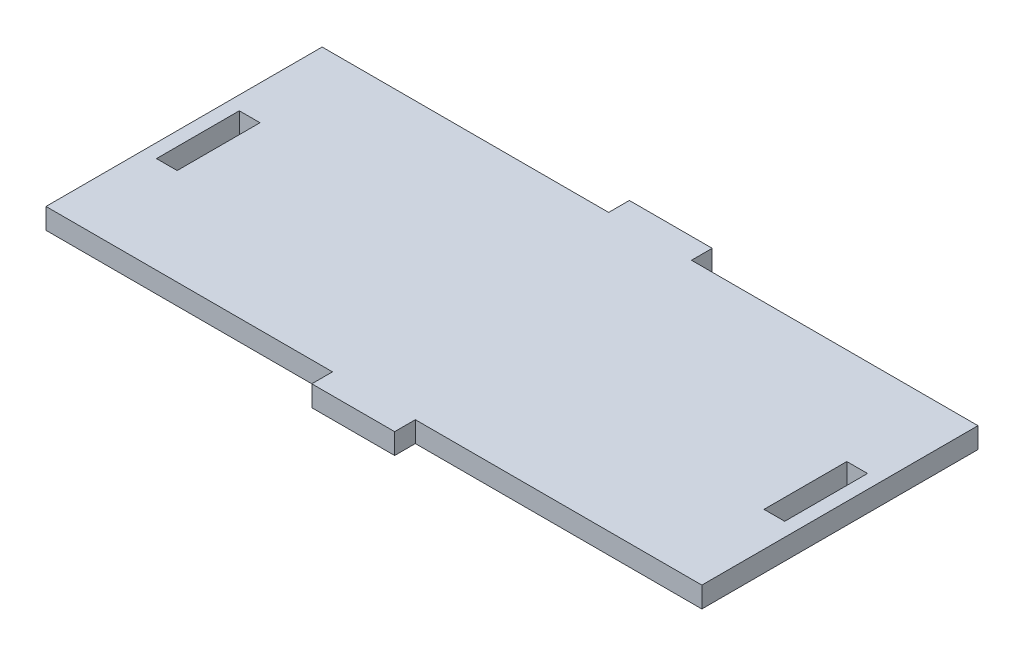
ISO-10303-21;
HEADER;
FILE_DESCRIPTION(('STEP AP214'),'2;1');
FILE_NAME('part.step','',(''),(''),'','','');
FILE_SCHEMA(('AUTOMOTIVE_DESIGN { 1 0 10303 214 1 1 1 1 }'));
ENDSEC;
DATA;
#1=APPLICATION_CONTEXT('core data for automotive mechanical design processes');
#2=APPLICATION_PROTOCOL_DEFINITION('international standard','automotive_design',2000,#1);
#3=PRODUCT_CONTEXT('',#1,'mechanical');
#4=PRODUCT('Part','Part','',(#3));
#5=PRODUCT_RELATED_PRODUCT_CATEGORY('part','',(#4));
#6=PRODUCT_DEFINITION_FORMATION('','',#4);
#7=PRODUCT_DEFINITION_CONTEXT('part definition',#1,'design');
#8=PRODUCT_DEFINITION('design','',#6,#7);
#9=PRODUCT_DEFINITION_SHAPE('','',#8);
#10=(LENGTH_UNIT() NAMED_UNIT(*) SI_UNIT(.MILLI.,.METRE.));
#11=(NAMED_UNIT(*) PLANE_ANGLE_UNIT() SI_UNIT($,.RADIAN.));
#12=(NAMED_UNIT(*) SI_UNIT($,.STERADIAN.) SOLID_ANGLE_UNIT());
#13=UNCERTAINTY_MEASURE_WITH_UNIT(LENGTH_MEASURE(1.E-05),#10,'distance_accuracy_value','');
#14=(GEOMETRIC_REPRESENTATION_CONTEXT(3) GLOBAL_UNCERTAINTY_ASSIGNED_CONTEXT((#13)) GLOBAL_UNIT_ASSIGNED_CONTEXT((#10,
#11,#12)) REPRESENTATION_CONTEXT('',''));
#15=CARTESIAN_POINT('',(0.,0.,0.));
#16=DIRECTION('',(0.,0.,1.));
#17=DIRECTION('',(1.,0.,0.));
#18=AXIS2_PLACEMENT_3D('',#15,#16,#17);
#19=CARTESIAN_POINT('',(0.,3.,7.49834222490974E-13));
#20=DIRECTION('',(0.,0.,-1.));
#21=DIRECTION('',(-1.,0.,0.));
#22=AXIS2_PLACEMENT_3D('',#19,#20,#21);
#23=PLANE('',#22);
#24=DIRECTION('',(1.,0.,0.));
#25=VECTOR('',#24,1.);
#26=CARTESIAN_POINT('',(0.,0.,7.49834222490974E-13));
#27=LINE('',#26,#25);
#28=CARTESIAN_POINT('',(51.5,0.,0.));
#29=VERTEX_POINT('',#28);
#30=CARTESIAN_POINT('',(93.,0.,0.));
#31=VERTEX_POINT('',#30);
#32=EDGE_CURVE('E232',#29,#31,#27,.T.);
#33=ORIENTED_EDGE('',*,*,#32,.F.);
#34=DIRECTION('',(0.,-1.,0.));
#35=VECTOR('',#34,1.);
#36=CARTESIAN_POINT('',(51.5,3.,0.));
#37=LINE('',#36,#35);
#38=CARTESIAN_POINT('',(51.5,3.,0.));
#39=VERTEX_POINT('',#38);
#40=EDGE_CURVE('E11',#39,#29,#37,.T.);
#41=ORIENTED_EDGE('',*,*,#40,.F.);
#42=DIRECTION('',(1.,0.,0.));
#43=VECTOR('',#42,1.);
#44=CARTESIAN_POINT('',(0.,3.,7.49834222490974E-13));
#45=LINE('',#44,#43);
#46=CARTESIAN_POINT('',(93.,3.,0.));
#47=VERTEX_POINT('',#46);
#48=EDGE_CURVE('E423',#39,#47,#45,.T.);
#49=ORIENTED_EDGE('',*,*,#48,.T.);
#50=DIRECTION('',(0.,-1.,0.));
#51=VECTOR('',#50,1.);
#52=CARTESIAN_POINT('',(93.,3.,0.));
#53=LINE('',#52,#51);
#54=EDGE_CURVE('E54',#47,#31,#53,.T.);
#55=ORIENTED_EDGE('',*,*,#54,.T.);
#56=EDGE_LOOP('',(#33,#41,#49,#55));
#57=FACE_BOUND('',#56,.T.);
#58=ADVANCED_FACE('F35',(#57),#23,.T.);
#59=CARTESIAN_POINT('',(51.5,3.,0.));
#60=DIRECTION('',(-1.,0.,0.));
#61=DIRECTION('',(0.,0.,1.));
#62=AXIS2_PLACEMENT_3D('',#59,#60,#61);
#63=PLANE('',#62);
#64=DIRECTION('',(0.,0.,-1.));
#65=VECTOR('',#64,1.);
#66=CARTESIAN_POINT('',(51.5,0.,0.));
#67=LINE('',#66,#65);
#68=CARTESIAN_POINT('',(51.5,0.,-3.));
#69=VERTEX_POINT('',#68);
#70=EDGE_CURVE('E234',#29,#69,#67,.T.);
#71=ORIENTED_EDGE('',*,*,#70,.T.);
#72=DIRECTION('',(0.,-1.,0.));
#73=VECTOR('',#72,1.);
#74=CARTESIAN_POINT('',(51.5,3.,-3.));
#75=LINE('',#74,#73);
#76=CARTESIAN_POINT('',(51.5,3.,-3.));
#77=VERTEX_POINT('',#76);
#78=EDGE_CURVE('E45',#77,#69,#75,.T.);
#79=ORIENTED_EDGE('',*,*,#78,.F.);
#80=DIRECTION('',(0.,0.,-1.));
#81=VECTOR('',#80,1.);
#82=CARTESIAN_POINT('',(51.5,3.,0.));
#83=LINE('',#82,#81);
#84=EDGE_CURVE('E412',#39,#77,#83,.T.);
#85=ORIENTED_EDGE('',*,*,#84,.F.);
#86=ORIENTED_EDGE('',*,*,#40,.T.);
#87=EDGE_LOOP('',(#71,#79,#85,#86));
#88=FACE_BOUND('',#87,.T.);
#89=ADVANCED_FACE('F328',(#88),#63,.F.);
#90=CARTESIAN_POINT('',(0.,3.,-3.));
#91=DIRECTION('',(0.,0.,-1.));
#92=DIRECTION('',(-1.,0.,0.));
#93=AXIS2_PLACEMENT_3D('',#90,#91,#92);
#94=PLANE('',#93);
#95=DIRECTION('',(1.,0.,0.));
#96=VECTOR('',#95,1.);
#97=CARTESIAN_POINT('',(0.,0.,-3.));
#98=LINE('',#97,#96);
#99=CARTESIAN_POINT('',(39.5,0.,-3.));
#100=VERTEX_POINT('',#99);
#101=EDGE_CURVE('E237',#100,#69,#98,.T.);
#102=ORIENTED_EDGE('',*,*,#101,.F.);
#103=DIRECTION('',(0.,-1.,0.));
#104=VECTOR('',#103,1.);
#105=CARTESIAN_POINT('',(39.5,3.,-3.));
#106=LINE('',#105,#104);
#107=CARTESIAN_POINT('',(39.5,3.,-3.));
#108=VERTEX_POINT('',#107);
#109=EDGE_CURVE('E282',#108,#100,#106,.T.);
#110=ORIENTED_EDGE('',*,*,#109,.F.);
#111=DIRECTION('',(1.,0.,0.));
#112=VECTOR('',#111,1.);
#113=CARTESIAN_POINT('',(0.,3.,-3.));
#114=LINE('',#113,#112);
#115=EDGE_CURVE('E408',#108,#77,#114,.T.);
#116=ORIENTED_EDGE('',*,*,#115,.T.);
#117=ORIENTED_EDGE('',*,*,#78,.T.);
#118=EDGE_LOOP('',(#102,#110,#116,#117));
#119=FACE_BOUND('',#118,.T.);
#120=ADVANCED_FACE('F333',(#119),#94,.T.);
#121=CARTESIAN_POINT('',(39.5,3.,0.));
#122=DIRECTION('',(-1.,0.,0.));
#123=DIRECTION('',(0.,0.,1.));
#124=AXIS2_PLACEMENT_3D('',#121,#122,#123);
#125=PLANE('',#124);
#126=DIRECTION('',(0.,0.,-1.));
#127=VECTOR('',#126,1.);
#128=CARTESIAN_POINT('',(39.5,0.,0.));
#129=LINE('',#128,#127);
#130=CARTESIAN_POINT('',(39.5,0.,0.));
#131=VERTEX_POINT('',#130);
#132=EDGE_CURVE('E240',#131,#100,#129,.T.);
#133=ORIENTED_EDGE('',*,*,#132,.F.);
#134=DIRECTION('',(0.,-1.,0.));
#135=VECTOR('',#134,1.);
#136=CARTESIAN_POINT('',(39.5,3.,0.));
#137=LINE('',#136,#135);
#138=CARTESIAN_POINT('',(39.5,3.,0.));
#139=VERTEX_POINT('',#138);
#140=EDGE_CURVE('E280',#139,#131,#137,.T.);
#141=ORIENTED_EDGE('',*,*,#140,.F.);
#142=DIRECTION('',(0.,0.,-1.));
#143=VECTOR('',#142,1.);
#144=CARTESIAN_POINT('',(39.5,3.,0.));
#145=LINE('',#144,#143);
#146=EDGE_CURVE('E404',#139,#108,#145,.T.);
#147=ORIENTED_EDGE('',*,*,#146,.T.);
#148=ORIENTED_EDGE('',*,*,#109,.T.);
#149=EDGE_LOOP('',(#133,#141,#147,#148));
#150=FACE_BOUND('',#149,.T.);
#151=ADVANCED_FACE('F385',(#150),#125,.T.);
#152=CARTESIAN_POINT('',(0.,3.,0.));
#153=DIRECTION('',(0.,0.,-1.));
#154=DIRECTION('',(-1.,0.,0.));
#155=AXIS2_PLACEMENT_3D('',#152,#153,#154);
#156=PLANE('',#155);
#157=DIRECTION('',(1.,0.,0.));
#158=VECTOR('',#157,1.);
#159=CARTESIAN_POINT('',(0.,0.,0.));
#160=LINE('',#159,#158);
#161=CARTESIAN_POINT('',(-1.99999999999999,0.,0.));
#162=VERTEX_POINT('',#161);
#163=EDGE_CURVE('E243',#162,#131,#160,.T.);
#164=ORIENTED_EDGE('',*,*,#163,.F.);
#165=DIRECTION('',(0.,-1.,0.));
#166=VECTOR('',#165,1.);
#167=CARTESIAN_POINT('',(-1.99999999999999,3.,0.));
#168=LINE('',#167,#166);
#169=CARTESIAN_POINT('',(-1.99999999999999,3.,0.));
#170=VERTEX_POINT('',#169);
#171=EDGE_CURVE('E278',#170,#162,#168,.T.);
#172=ORIENTED_EDGE('',*,*,#171,.F.);
#173=DIRECTION('',(1.,0.,0.));
#174=VECTOR('',#173,1.);
#175=CARTESIAN_POINT('',(0.,3.,0.));
#176=LINE('',#175,#174);
#177=EDGE_CURVE('E407',#170,#139,#176,.T.);
#178=ORIENTED_EDGE('',*,*,#177,.T.);
#179=ORIENTED_EDGE('',*,*,#140,.T.);
#180=EDGE_LOOP('',(#164,#172,#178,#179));
#181=FACE_BOUND('',#180,.T.);
#182=ADVANCED_FACE('F381',(#181),#156,.T.);
#183=CARTESIAN_POINT('',(-1.99999999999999,3.,0.));
#184=DIRECTION('',(1.,0.,0.));
#185=DIRECTION('',(0.,0.,-1.));
#186=AXIS2_PLACEMENT_3D('',#183,#184,#185);
#187=PLANE('',#186);
#188=DIRECTION('',(0.,0.,1.));
#189=VECTOR('',#188,1.);
#190=CARTESIAN_POINT('',(-1.99999999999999,0.,0.));
#191=LINE('',#190,#189);
#192=CARTESIAN_POINT('',(-1.99999999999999,0.,40.));
#193=VERTEX_POINT('',#192);
#194=EDGE_CURVE('E246',#162,#193,#191,.T.);
#195=ORIENTED_EDGE('',*,*,#194,.T.);
#196=DIRECTION('',(0.,-1.,0.));
#197=VECTOR('',#196,1.);
#198=CARTESIAN_POINT('',(-1.99999999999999,3.,40.));
#199=LINE('',#198,#197);
#200=CARTESIAN_POINT('',(-1.99999999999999,3.,40.));
#201=VERTEX_POINT('',#200);
#202=EDGE_CURVE('E275',#201,#193,#199,.T.);
#203=ORIENTED_EDGE('',*,*,#202,.F.);
#204=DIRECTION('',(0.,0.,1.));
#205=VECTOR('',#204,1.);
#206=CARTESIAN_POINT('',(-1.99999999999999,3.,0.));
#207=LINE('',#206,#205);
#208=EDGE_CURVE('E410',#170,#201,#207,.T.);
#209=ORIENTED_EDGE('',*,*,#208,.F.);
#210=ORIENTED_EDGE('',*,*,#171,.T.);
#211=EDGE_LOOP('',(#195,#203,#209,#210));
#212=FACE_BOUND('',#211,.T.);
#213=ADVANCED_FACE('F377',(#212),#187,.F.);
#214=CARTESIAN_POINT('',(0.,3.,40.));
#215=DIRECTION('',(0.,0.,-1.));
#216=DIRECTION('',(-1.,0.,0.));
#217=AXIS2_PLACEMENT_3D('',#214,#215,#216);
#218=PLANE('',#217);
#219=DIRECTION('',(1.,0.,0.));
#220=VECTOR('',#219,1.);
#221=CARTESIAN_POINT('',(0.,0.,40.));
#222=LINE('',#221,#220);
#223=CARTESIAN_POINT('',(39.5,0.,40.));
#224=VERTEX_POINT('',#223);
#225=EDGE_CURVE('E249',#193,#224,#222,.T.);
#226=ORIENTED_EDGE('',*,*,#225,.T.);
#227=DIRECTION('',(0.,-1.,0.));
#228=VECTOR('',#227,1.);
#229=CARTESIAN_POINT('',(39.5,3.,40.));
#230=LINE('',#229,#228);
#231=CARTESIAN_POINT('',(39.5,3.,40.));
#232=VERTEX_POINT('',#231);
#233=EDGE_CURVE('E272',#232,#224,#230,.T.);
#234=ORIENTED_EDGE('',*,*,#233,.F.);
#235=DIRECTION('',(1.,0.,0.));
#236=VECTOR('',#235,1.);
#237=CARTESIAN_POINT('',(0.,3.,40.));
#238=LINE('',#237,#236);
#239=EDGE_CURVE('E418',#201,#232,#238,.T.);
#240=ORIENTED_EDGE('',*,*,#239,.F.);
#241=ORIENTED_EDGE('',*,*,#202,.T.);
#242=EDGE_LOOP('',(#226,#234,#240,#241));
#243=FACE_BOUND('',#242,.T.);
#244=ADVANCED_FACE('F373',(#243),#218,.F.);
#245=CARTESIAN_POINT('',(39.5,3.,0.));
#246=DIRECTION('',(1.,0.,0.));
#247=DIRECTION('',(0.,0.,-1.));
#248=AXIS2_PLACEMENT_3D('',#245,#246,#247);
#249=PLANE('',#248);
#250=DIRECTION('',(0.,0.,1.));
#251=VECTOR('',#250,1.);
#252=CARTESIAN_POINT('',(39.5,0.,0.));
#253=LINE('',#252,#251);
#254=CARTESIAN_POINT('',(39.5,0.,43.));
#255=VERTEX_POINT('',#254);
#256=EDGE_CURVE('E252',#224,#255,#253,.T.);
#257=ORIENTED_EDGE('',*,*,#256,.T.);
#258=DIRECTION('',(0.,-1.,0.));
#259=VECTOR('',#258,1.);
#260=CARTESIAN_POINT('',(39.5,3.,43.));
#261=LINE('',#260,#259);
#262=CARTESIAN_POINT('',(39.5,3.,43.));
#263=VERTEX_POINT('',#262);
#264=EDGE_CURVE('E269',#263,#255,#261,.T.);
#265=ORIENTED_EDGE('',*,*,#264,.F.);
#266=DIRECTION('',(0.,0.,1.));
#267=VECTOR('',#266,1.);
#268=CARTESIAN_POINT('',(39.5,3.,0.));
#269=LINE('',#268,#267);
#270=EDGE_CURVE('E203',#232,#263,#269,.T.);
#271=ORIENTED_EDGE('',*,*,#270,.F.);
#272=ORIENTED_EDGE('',*,*,#233,.T.);
#273=EDGE_LOOP('',(#257,#265,#271,#272));
#274=FACE_BOUND('',#273,.T.);
#275=ADVANCED_FACE('F369',(#274),#249,.F.);
#276=CARTESIAN_POINT('',(0.,3.,43.));
#277=DIRECTION('',(0.,0.,-1.));
#278=DIRECTION('',(-1.,0.,0.));
#279=AXIS2_PLACEMENT_3D('',#276,#277,#278);
#280=PLANE('',#279);
#281=DIRECTION('',(1.,0.,0.));
#282=VECTOR('',#281,1.);
#283=CARTESIAN_POINT('',(0.,0.,43.));
#284=LINE('',#283,#282);
#285=CARTESIAN_POINT('',(51.5,0.,43.));
#286=VERTEX_POINT('',#285);
#287=EDGE_CURVE('E255',#255,#286,#284,.T.);
#288=ORIENTED_EDGE('',*,*,#287,.T.);
#289=DIRECTION('',(0.,-1.,0.));
#290=VECTOR('',#289,1.);
#291=CARTESIAN_POINT('',(51.5,3.,43.));
#292=LINE('',#291,#290);
#293=CARTESIAN_POINT('',(51.5,3.,43.));
#294=VERTEX_POINT('',#293);
#295=EDGE_CURVE('E189',#294,#286,#292,.T.);
#296=ORIENTED_EDGE('',*,*,#295,.F.);
#297=DIRECTION('',(1.,0.,0.));
#298=VECTOR('',#297,1.);
#299=CARTESIAN_POINT('',(0.,3.,43.));
#300=LINE('',#299,#298);
#301=EDGE_CURVE('E200',#263,#294,#300,.T.);
#302=ORIENTED_EDGE('',*,*,#301,.F.);
#303=ORIENTED_EDGE('',*,*,#264,.T.);
#304=EDGE_LOOP('',(#288,#296,#302,#303));
#305=FACE_BOUND('',#304,.T.);
#306=ADVANCED_FACE('F366',(#305),#280,.F.);
#307=CARTESIAN_POINT('',(51.5,3.,0.));
#308=DIRECTION('',(1.,0.,0.));
#309=DIRECTION('',(0.,0.,-1.));
#310=AXIS2_PLACEMENT_3D('',#307,#308,#309);
#311=PLANE('',#310);
#312=DIRECTION('',(0.,0.,1.));
#313=VECTOR('',#312,1.);
#314=CARTESIAN_POINT('',(51.5,0.,0.));
#315=LINE('',#314,#313);
#316=CARTESIAN_POINT('',(51.5,0.,40.));
#317=VERTEX_POINT('',#316);
#318=EDGE_CURVE('E186',#317,#286,#315,.T.);
#319=ORIENTED_EDGE('',*,*,#318,.F.);
#320=DIRECTION('',(0.,-1.,0.));
#321=VECTOR('',#320,1.);
#322=CARTESIAN_POINT('',(51.5,3.,40.));
#323=LINE('',#322,#321);
#324=CARTESIAN_POINT('',(51.5,3.,40.));
#325=VERTEX_POINT('',#324);
#326=EDGE_CURVE('E180',#325,#317,#323,.T.);
#327=ORIENTED_EDGE('',*,*,#326,.F.);
#328=DIRECTION('',(0.,0.,1.));
#329=VECTOR('',#328,1.);
#330=CARTESIAN_POINT('',(51.5,3.,0.));
#331=LINE('',#330,#329);
#332=EDGE_CURVE('E184',#325,#294,#331,.T.);
#333=ORIENTED_EDGE('',*,*,#332,.T.);
#334=ORIENTED_EDGE('',*,*,#295,.T.);
#335=EDGE_LOOP('',(#319,#327,#333,#334));
#336=FACE_BOUND('',#335,.T.);
#337=ADVANCED_FACE('F182',(#336),#311,.T.);
#338=CARTESIAN_POINT('',(2.77555756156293E-13,3.,40.0000000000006));
#339=DIRECTION('',(0.,0.,-1.));
#340=DIRECTION('',(-1.,0.,0.));
#341=AXIS2_PLACEMENT_3D('',#338,#339,#340);
#342=PLANE('',#341);
#343=DIRECTION('',(1.,0.,0.));
#344=VECTOR('',#343,1.);
#345=CARTESIAN_POINT('',(2.77555756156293E-13,0.,40.0000000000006));
#346=LINE('',#345,#344);
#347=CARTESIAN_POINT('',(93.,0.,40.));
#348=VERTEX_POINT('',#347);
#349=EDGE_CURVE('E259',#317,#348,#346,.T.);
#350=ORIENTED_EDGE('',*,*,#349,.T.);
#351=DIRECTION('',(0.,-1.,0.));
#352=VECTOR('',#351,1.);
#353=CARTESIAN_POINT('',(93.,3.,40.));
#354=LINE('',#353,#352);
#355=CARTESIAN_POINT('',(93.,3.,40.));
#356=VERTEX_POINT('',#355);
#357=EDGE_CURVE('E116',#356,#348,#354,.T.);
#358=ORIENTED_EDGE('',*,*,#357,.F.);
#359=DIRECTION('',(1.,0.,0.));
#360=VECTOR('',#359,1.);
#361=CARTESIAN_POINT('',(2.77555756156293E-13,3.,40.0000000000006));
#362=LINE('',#361,#360);
#363=EDGE_CURVE('E191',#325,#356,#362,.T.);
#364=ORIENTED_EDGE('',*,*,#363,.F.);
#365=ORIENTED_EDGE('',*,*,#326,.T.);
#366=EDGE_LOOP('',(#350,#358,#364,#365));
#367=FACE_BOUND('',#366,.T.);
#368=ADVANCED_FACE('F192',(#367),#342,.F.);
#369=CARTESIAN_POINT('',(0.,3.,0.));
#370=DIRECTION('',(1.,0.,0.));
#371=DIRECTION('',(0.,0.,-1.));
#372=AXIS2_PLACEMENT_3D('',#369,#370,#371);
#373=PLANE('',#372);
#374=DIRECTION('',(0.,0.,1.));
#375=VECTOR('',#374,1.);
#376=CARTESIAN_POINT('',(0.,0.,0.));
#377=LINE('',#376,#375);
#378=CARTESIAN_POINT('',(0.,0.,14.));
#379=VERTEX_POINT('',#378);
#380=CARTESIAN_POINT('',(0.,0.,26.));
#381=VERTEX_POINT('',#380);
#382=EDGE_CURVE('E220',#379,#381,#377,.T.);
#383=ORIENTED_EDGE('',*,*,#382,.F.);
#384=DIRECTION('',(0.,-1.,0.));
#385=VECTOR('',#384,1.);
#386=CARTESIAN_POINT('',(0.,3.,14.));
#387=LINE('',#386,#385);
#388=CARTESIAN_POINT('',(0.,3.,14.));
#389=VERTEX_POINT('',#388);
#390=EDGE_CURVE('E266',#389,#379,#387,.T.);
#391=ORIENTED_EDGE('',*,*,#390,.F.);
#392=DIRECTION('',(0.,0.,1.));
#393=VECTOR('',#392,1.);
#394=CARTESIAN_POINT('',(0.,3.,0.));
#395=LINE('',#394,#393);
#396=CARTESIAN_POINT('',(0.,3.,26.));
#397=VERTEX_POINT('',#396);
#398=EDGE_CURVE('E434',#389,#397,#395,.T.);
#399=ORIENTED_EDGE('',*,*,#398,.T.);
#400=DIRECTION('',(0.,-1.,0.));
#401=VECTOR('',#400,1.);
#402=CARTESIAN_POINT('',(0.,3.,26.));
#403=LINE('',#402,#401);
#404=EDGE_CURVE('E285',#397,#381,#403,.T.);
#405=ORIENTED_EDGE('',*,*,#404,.T.);
#406=EDGE_LOOP('',(#383,#391,#399,#405));
#407=FACE_BOUND('',#406,.T.);
#408=ADVANCED_FACE('F345',(#407),#373,.T.);
#409=CARTESIAN_POINT('',(0.,3.,14.));
#410=DIRECTION('',(0.,0.,-1.));
#411=DIRECTION('',(-1.,0.,0.));
#412=AXIS2_PLACEMENT_3D('',#409,#410,#411);
#413=PLANE('',#412);
#414=DIRECTION('',(1.,0.,0.));
#415=VECTOR('',#414,1.);
#416=CARTESIAN_POINT('',(0.,0.,14.));
#417=LINE('',#416,#415);
#418=CARTESIAN_POINT('',(3.,0.,14.));
#419=VERTEX_POINT('',#418);
#420=EDGE_CURVE('E223',#379,#419,#417,.T.);
#421=ORIENTED_EDGE('',*,*,#420,.T.);
#422=DIRECTION('',(0.,-1.,0.));
#423=VECTOR('',#422,1.);
#424=CARTESIAN_POINT('',(3.,3.,14.));
#425=LINE('',#424,#423);
#426=CARTESIAN_POINT('',(3.,3.,14.));
#427=VERTEX_POINT('',#426);
#428=EDGE_CURVE('E289',#427,#419,#425,.T.);
#429=ORIENTED_EDGE('',*,*,#428,.F.);
#430=DIRECTION('',(1.,0.,0.));
#431=VECTOR('',#430,1.);
#432=CARTESIAN_POINT('',(0.,3.,14.));
#433=LINE('',#432,#431);
#434=EDGE_CURVE('E431',#389,#427,#433,.T.);
#435=ORIENTED_EDGE('',*,*,#434,.F.);
#436=ORIENTED_EDGE('',*,*,#390,.T.);
#437=EDGE_LOOP('',(#421,#429,#435,#436));
#438=FACE_BOUND('',#437,.T.);
#439=ADVANCED_FACE('F341',(#438),#413,.F.);
#440=CARTESIAN_POINT('',(3.,3.,0.));
#441=DIRECTION('',(1.,0.,0.));
#442=DIRECTION('',(0.,0.,-1.));
#443=AXIS2_PLACEMENT_3D('',#440,#441,#442);
#444=PLANE('',#443);
#445=DIRECTION('',(0.,0.,1.));
#446=VECTOR('',#445,1.);
#447=CARTESIAN_POINT('',(3.,0.,0.));
#448=LINE('',#447,#446);
#449=CARTESIAN_POINT('',(3.,0.,26.));
#450=VERTEX_POINT('',#449);
#451=EDGE_CURVE('E226',#419,#450,#448,.T.);
#452=ORIENTED_EDGE('',*,*,#451,.T.);
#453=DIRECTION('',(0.,-1.,0.));
#454=VECTOR('',#453,1.);
#455=CARTESIAN_POINT('',(3.,3.,26.));
#456=LINE('',#455,#454);
#457=CARTESIAN_POINT('',(3.,3.,26.));
#458=VERTEX_POINT('',#457);
#459=EDGE_CURVE('E287',#458,#450,#456,.T.);
#460=ORIENTED_EDGE('',*,*,#459,.F.);
#461=DIRECTION('',(0.,0.,1.));
#462=VECTOR('',#461,1.);
#463=CARTESIAN_POINT('',(3.,3.,0.));
#464=LINE('',#463,#462);
#465=EDGE_CURVE('E427',#427,#458,#464,.T.);
#466=ORIENTED_EDGE('',*,*,#465,.F.);
#467=ORIENTED_EDGE('',*,*,#428,.T.);
#468=EDGE_LOOP('',(#452,#460,#466,#467));
#469=FACE_BOUND('',#468,.T.);
#470=ADVANCED_FACE('F338',(#469),#444,.F.);
#471=CARTESIAN_POINT('',(0.,3.,14.0000000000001));
#472=DIRECTION('',(0.,0.,1.));
#473=DIRECTION('',(1.,0.,0.));
#474=AXIS2_PLACEMENT_3D('',#471,#472,#473);
#475=PLANE('',#474);
#476=DIRECTION('',(-1.,0.,0.));
#477=VECTOR('',#476,1.);
#478=CARTESIAN_POINT('',(0.,0.,14.0000000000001));
#479=LINE('',#478,#477);
#480=CARTESIAN_POINT('',(91.,0.,14.));
#481=VERTEX_POINT('',#480);
#482=CARTESIAN_POINT('',(88.,0.,14.));
#483=VERTEX_POINT('',#482);
#484=EDGE_CURVE('E209',#481,#483,#479,.T.);
#485=ORIENTED_EDGE('',*,*,#484,.F.);
#486=DIRECTION('',(0.,-1.,0.));
#487=VECTOR('',#486,1.);
#488=CARTESIAN_POINT('',(91.,3.,14.));
#489=LINE('',#488,#487);
#490=CARTESIAN_POINT('',(91.,3.,14.));
#491=VERTEX_POINT('',#490);
#492=EDGE_CURVE('E39',#491,#481,#489,.T.);
#493=ORIENTED_EDGE('',*,*,#492,.F.);
#494=DIRECTION('',(-1.,0.,0.));
#495=VECTOR('',#494,1.);
#496=CARTESIAN_POINT('',(0.,3.,14.0000000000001));
#497=LINE('',#496,#495);
#498=CARTESIAN_POINT('',(88.,3.,14.));
#499=VERTEX_POINT('',#498);
#500=EDGE_CURVE('E264',#491,#499,#497,.T.);
#501=ORIENTED_EDGE('',*,*,#500,.T.);
#502=DIRECTION('',(0.,-1.,0.));
#503=VECTOR('',#502,1.);
#504=CARTESIAN_POINT('',(88.,3.,14.));
#505=LINE('',#504,#503);
#506=EDGE_CURVE('E208',#499,#483,#505,.T.);
#507=ORIENTED_EDGE('',*,*,#506,.T.);
#508=EDGE_LOOP('',(#485,#493,#501,#507));
#509=FACE_BOUND('',#508,.T.);
#510=ADVANCED_FACE('F37',(#509),#475,.T.);
#511=CARTESIAN_POINT('',(91.,3.,0.));
#512=DIRECTION('',(1.,0.,0.));
#513=DIRECTION('',(0.,0.,-1.));
#514=AXIS2_PLACEMENT_3D('',#511,#512,#513);
#515=PLANE('',#514);
#516=DIRECTION('',(0.,0.,1.));
#517=VECTOR('',#516,1.);
#518=CARTESIAN_POINT('',(91.,0.,0.));
#519=LINE('',#518,#517);
#520=CARTESIAN_POINT('',(91.,0.,26.));
#521=VERTEX_POINT('',#520);
#522=EDGE_CURVE('E212',#481,#521,#519,.T.);
#523=ORIENTED_EDGE('',*,*,#522,.T.);
#524=DIRECTION('',(0.,-1.,0.));
#525=VECTOR('',#524,1.);
#526=CARTESIAN_POINT('',(91.,3.,26.));
#527=LINE('',#526,#525);
#528=CARTESIAN_POINT('',(91.,3.,26.));
#529=VERTEX_POINT('',#528);
#530=EDGE_CURVE('E295',#529,#521,#527,.T.);
#531=ORIENTED_EDGE('',*,*,#530,.F.);
#532=DIRECTION('',(0.,0.,1.));
#533=VECTOR('',#532,1.);
#534=CARTESIAN_POINT('',(91.,3.,0.));
#535=LINE('',#534,#533);
#536=EDGE_CURVE('E304',#491,#529,#535,.T.);
#537=ORIENTED_EDGE('',*,*,#536,.F.);
#538=ORIENTED_EDGE('',*,*,#492,.T.);
#539=EDGE_LOOP('',(#523,#531,#537,#538));
#540=FACE_BOUND('',#539,.T.);
#541=ADVANCED_FACE('F303',(#540),#515,.F.);
#542=CARTESIAN_POINT('',(0.,3.,26.));
#543=DIRECTION('',(0.,0.,1.));
#544=DIRECTION('',(1.,0.,0.));
#545=AXIS2_PLACEMENT_3D('',#542,#543,#544);
#546=PLANE('',#545);
#547=DIRECTION('',(-1.,0.,0.));
#548=VECTOR('',#547,1.);
#549=CARTESIAN_POINT('',(0.,0.,26.));
#550=LINE('',#549,#548);
#551=CARTESIAN_POINT('',(88.,0.,26.));
#552=VERTEX_POINT('',#551);
#553=EDGE_CURVE('E214',#521,#552,#550,.T.);
#554=ORIENTED_EDGE('',*,*,#553,.T.);
#555=DIRECTION('',(0.,-1.,0.));
#556=VECTOR('',#555,1.);
#557=CARTESIAN_POINT('',(88.,3.,26.));
#558=LINE('',#557,#556);
#559=CARTESIAN_POINT('',(88.,3.,26.));
#560=VERTEX_POINT('',#559);
#561=EDGE_CURVE('E294',#560,#552,#558,.T.);
#562=ORIENTED_EDGE('',*,*,#561,.F.);
#563=DIRECTION('',(-1.,0.,0.));
#564=VECTOR('',#563,1.);
#565=CARTESIAN_POINT('',(0.,3.,26.));
#566=LINE('',#565,#564);
#567=EDGE_CURVE('E438',#529,#560,#566,.T.);
#568=ORIENTED_EDGE('',*,*,#567,.F.);
#569=ORIENTED_EDGE('',*,*,#530,.T.);
#570=EDGE_LOOP('',(#554,#562,#568,#569));
#571=FACE_BOUND('',#570,.T.);
#572=ADVANCED_FACE('F316',(#571),#546,.F.);
#573=CARTESIAN_POINT('',(0.,3.,26.));
#574=DIRECTION('',(0.,0.,-1.));
#575=DIRECTION('',(-1.,0.,0.));
#576=AXIS2_PLACEMENT_3D('',#573,#574,#575);
#577=PLANE('',#576);
#578=DIRECTION('',(1.,0.,0.));
#579=VECTOR('',#578,1.);
#580=CARTESIAN_POINT('',(0.,0.,26.));
#581=LINE('',#580,#579);
#582=EDGE_CURVE('E229',#381,#450,#581,.T.);
#583=ORIENTED_EDGE('',*,*,#582,.F.);
#584=ORIENTED_EDGE('',*,*,#404,.F.);
#585=DIRECTION('',(1.,0.,0.));
#586=VECTOR('',#585,1.);
#587=CARTESIAN_POINT('',(0.,3.,26.));
#588=LINE('',#587,#586);
#589=EDGE_CURVE('E424',#397,#458,#588,.T.);
#590=ORIENTED_EDGE('',*,*,#589,.T.);
#591=ORIENTED_EDGE('',*,*,#459,.T.);
#592=EDGE_LOOP('',(#583,#584,#590,#591));
#593=FACE_BOUND('',#592,.T.);
#594=ADVANCED_FACE('F318',(#593),#577,.T.);
#595=CARTESIAN_POINT('',(88.,3.,-1.01770443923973E-13));
#596=DIRECTION('',(1.,0.,0.));
#597=DIRECTION('',(0.,0.,-1.));
#598=AXIS2_PLACEMENT_3D('',#595,#596,#597);
#599=PLANE('',#598);
#600=DIRECTION('',(0.,0.,1.));
#601=VECTOR('',#600,1.);
#602=CARTESIAN_POINT('',(88.,0.,-1.01770443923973E-13));
#603=LINE('',#602,#601);
#604=EDGE_CURVE('E217',#483,#552,#603,.T.);
#605=ORIENTED_EDGE('',*,*,#604,.F.);
#606=ORIENTED_EDGE('',*,*,#506,.F.);
#607=DIRECTION('',(0.,0.,1.));
#608=VECTOR('',#607,1.);
#609=CARTESIAN_POINT('',(88.,3.,-1.01770443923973E-13));
#610=LINE('',#609,#608);
#611=EDGE_CURVE('E314',#499,#560,#610,.T.);
#612=ORIENTED_EDGE('',*,*,#611,.T.);
#613=ORIENTED_EDGE('',*,*,#561,.T.);
#614=EDGE_LOOP('',(#605,#606,#612,#613));
#615=FACE_BOUND('',#614,.T.);
#616=ADVANCED_FACE('F313',(#615),#599,.T.);
#617=CARTESIAN_POINT('',(93.,3.,0.));
#618=DIRECTION('',(1.,0.,0.));
#619=DIRECTION('',(0.,0.,-1.));
#620=AXIS2_PLACEMENT_3D('',#617,#618,#619);
#621=PLANE('',#620);
#622=DIRECTION('',(0.,0.,1.));
#623=VECTOR('',#622,1.);
#624=CARTESIAN_POINT('',(93.,0.,0.));
#625=LINE('',#624,#623);
#626=EDGE_CURVE('E261',#31,#348,#625,.T.);
#627=ORIENTED_EDGE('',*,*,#626,.F.);
#628=ORIENTED_EDGE('',*,*,#54,.F.);
#629=DIRECTION('',(0.,0.,1.));
#630=VECTOR('',#629,1.);
#631=CARTESIAN_POINT('',(93.,3.,0.));
#632=LINE('',#631,#630);
#633=EDGE_CURVE('E195',#47,#356,#632,.T.);
#634=ORIENTED_EDGE('',*,*,#633,.T.);
#635=ORIENTED_EDGE('',*,*,#357,.T.);
#636=EDGE_LOOP('',(#627,#628,#634,#635));
#637=FACE_BOUND('',#636,.T.);
#638=ADVANCED_FACE('F350',(#637),#621,.T.);
#639=CARTESIAN_POINT('',(0.,3.,0.));
#640=DIRECTION('',(0.,1.,0.));
#641=DIRECTION('',(0.,0.,1.));
#642=AXIS2_PLACEMENT_3D('',#639,#640,#641);
#643=PLANE('',#642);
#644=ORIENTED_EDGE('',*,*,#500,.F.);
#645=ORIENTED_EDGE('',*,*,#536,.T.);
#646=ORIENTED_EDGE('',*,*,#567,.T.);
#647=ORIENTED_EDGE('',*,*,#611,.F.);
#648=EDGE_LOOP('',(#644,#645,#646,#647));
#649=FACE_BOUND('',#648,.T.);
#650=ORIENTED_EDGE('',*,*,#398,.F.);
#651=ORIENTED_EDGE('',*,*,#434,.T.);
#652=ORIENTED_EDGE('',*,*,#465,.T.);
#653=ORIENTED_EDGE('',*,*,#589,.F.);
#654=EDGE_LOOP('',(#650,#651,#652,#653));
#655=FACE_BOUND('',#654,.T.);
#656=ORIENTED_EDGE('',*,*,#48,.F.);
#657=ORIENTED_EDGE('',*,*,#84,.T.);
#658=ORIENTED_EDGE('',*,*,#115,.F.);
#659=ORIENTED_EDGE('',*,*,#146,.F.);
#660=ORIENTED_EDGE('',*,*,#177,.F.);
#661=ORIENTED_EDGE('',*,*,#208,.T.);
#662=ORIENTED_EDGE('',*,*,#239,.T.);
#663=ORIENTED_EDGE('',*,*,#270,.T.);
#664=ORIENTED_EDGE('',*,*,#301,.T.);
#665=ORIENTED_EDGE('',*,*,#332,.F.);
#666=ORIENTED_EDGE('',*,*,#363,.T.);
#667=ORIENTED_EDGE('',*,*,#633,.F.);
#668=EDGE_LOOP('',(#656,#657,#658,#659,#660,#661,#662,#663,#664,#665,#666,#667));
#669=FACE_BOUND('',#668,.T.);
#670=ADVANCED_FACE('F198',(#649,#655,#669),#643,.T.);
#671=CARTESIAN_POINT('',(0.,0.,0.));
#672=DIRECTION('',(0.,1.,0.));
#673=DIRECTION('',(0.,0.,1.));
#674=AXIS2_PLACEMENT_3D('',#671,#672,#673);
#675=PLANE('',#674);
#676=ORIENTED_EDGE('',*,*,#484,.T.);
#677=ORIENTED_EDGE('',*,*,#604,.T.);
#678=ORIENTED_EDGE('',*,*,#553,.F.);
#679=ORIENTED_EDGE('',*,*,#522,.F.);
#680=EDGE_LOOP('',(#676,#677,#678,#679));
#681=FACE_BOUND('',#680,.T.);
#682=ORIENTED_EDGE('',*,*,#382,.T.);
#683=ORIENTED_EDGE('',*,*,#582,.T.);
#684=ORIENTED_EDGE('',*,*,#451,.F.);
#685=ORIENTED_EDGE('',*,*,#420,.F.);
#686=EDGE_LOOP('',(#682,#683,#684,#685));
#687=FACE_BOUND('',#686,.T.);
#688=ORIENTED_EDGE('',*,*,#32,.T.);
#689=ORIENTED_EDGE('',*,*,#626,.T.);
#690=ORIENTED_EDGE('',*,*,#349,.F.);
#691=ORIENTED_EDGE('',*,*,#318,.T.);
#692=ORIENTED_EDGE('',*,*,#287,.F.);
#693=ORIENTED_EDGE('',*,*,#256,.F.);
#694=ORIENTED_EDGE('',*,*,#225,.F.);
#695=ORIENTED_EDGE('',*,*,#194,.F.);
#696=ORIENTED_EDGE('',*,*,#163,.T.);
#697=ORIENTED_EDGE('',*,*,#132,.T.);
#698=ORIENTED_EDGE('',*,*,#101,.T.);
#699=ORIENTED_EDGE('',*,*,#70,.F.);
#700=EDGE_LOOP('',(#688,#689,#690,#691,#692,#693,#694,#695,#696,#697,#698,#699));
#701=FACE_BOUND('',#700,.T.);
#702=ADVANCED_FACE('F307',(#681,#687,#701),#675,.F.);
#703=CLOSED_SHELL('',(#58,#89,#120,#151,#182,#213,#244,#275,#306,#337,#368,#408,#439,#470,#510,
#541,#572,#594,#616,#638,#670,#702));
#704=MANIFOLD_SOLID_BREP('B2',#703);
#705=ADVANCED_BREP_SHAPE_REPRESENTATION('',(#18,#704),#14);
#706=SHAPE_DEFINITION_REPRESENTATION(#9,#705);
ENDSEC;
END-ISO-10303-21;
